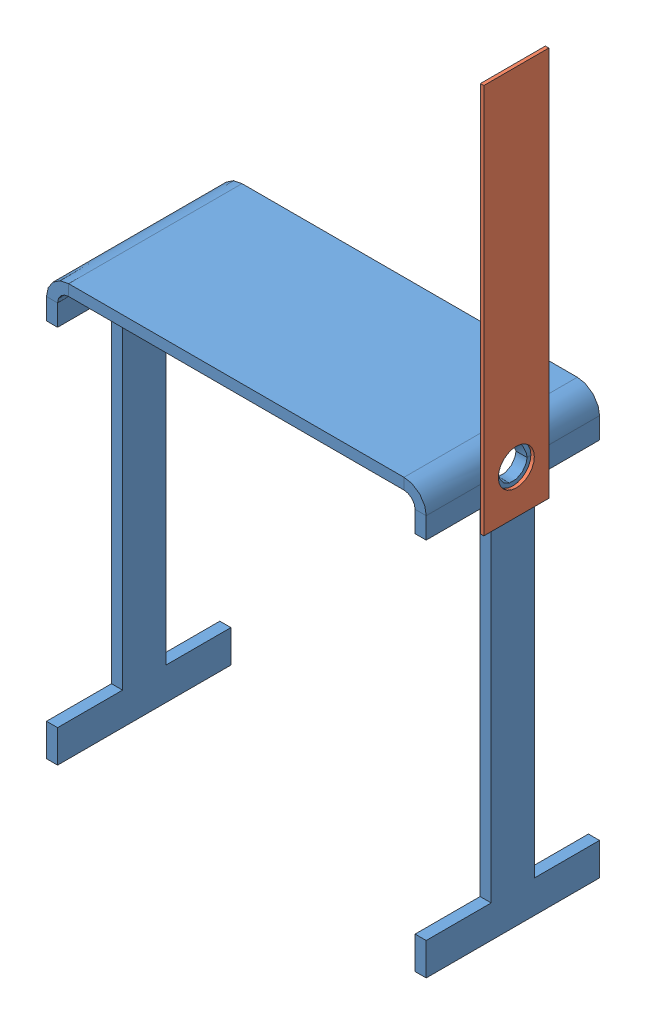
SolidWorks assembly A3002017527.sldasm, configuration Default (file format 3100). Lengths in mm.
Overall size (28.07 54.77 12.7).
2 component instances, 2 part files, 3 mates.
Components (placement in the parent):
- A1003511728-1: A1003511728.SLDPRT [Default] at origin size (27.82 30.96 12.7)
- A1003534727-1: A1003534727.SLDPRT [Default] at (14.1637 26.1937 0) x (0 0 1) z (-1 0 0) size (4.76 28.57 0.25)
Mates (geometry in assembly coordinates):
- Concentric1: concentric aligned: cylinder of A1003534727-1; cylinder of A1003511728-1
- Coincident2: coincident anti-aligned: plane of A1003511728-1 through (13.9097 30.1434 6.35) normal (1 0 0); plane of A1003534727-1 through (13.9097 54.7687 -2.3813) normal (-1 0 0)
- Parallel1: parallel aligned: plane of A1003511728-1 through (13.9097 27.7812 1.5875) normal (0 0 1); plane of A1003534727-1 through (13.9097 26.1937 2.3813) normal (0 0 1)
